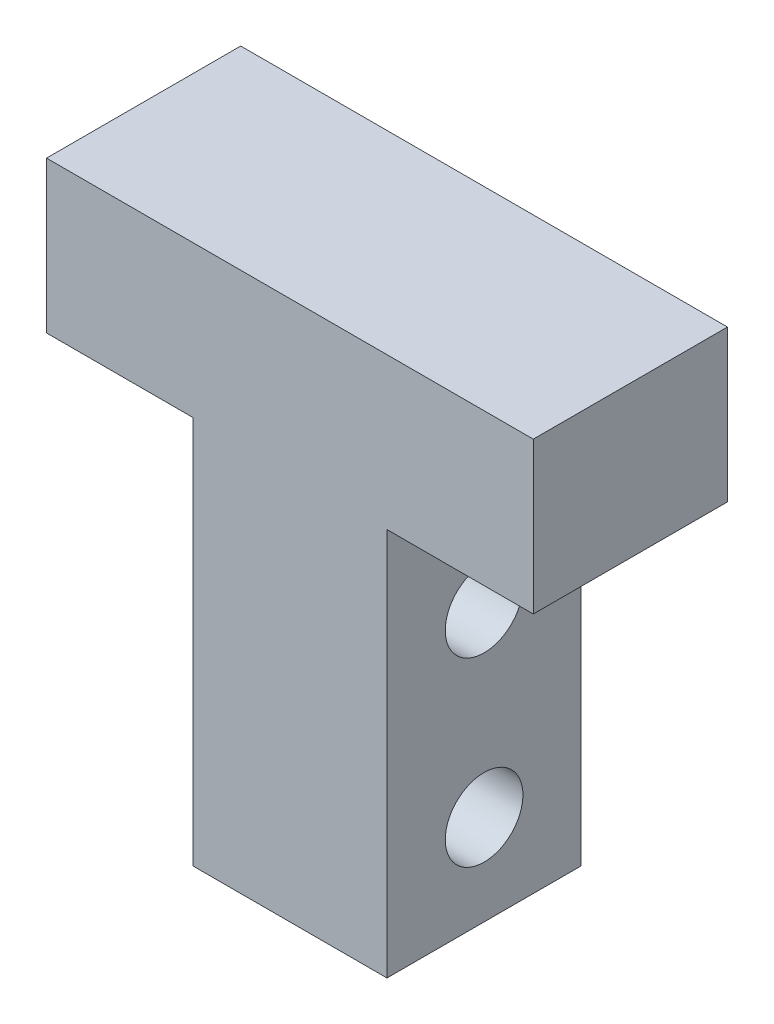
from build123d import *

# Parameters (mm, degrees)
BOSS_EXTRUDE1_DEPTH = 15
SKETCH2_R           = 3
CUT_EXTRUDE1_DEPTH  = 47.924540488


with BuildPart() as part:
    # Sketch1 → Boss-Extrude1 (new body)
    with BuildSketch(Plane.XY):
        Polygon((7.5, -5.85), (18.8, -5.85), (18.8, 5.85), (-18.8, 5.85), (-18.8, -5.85), (-7.5, -5.85), (-7.5, -35.85), (7.5, -35.85), align=None)
    extrude(amount=BOSS_EXTRUDE1_DEPTH)

    # Sketch2 → Cut-Extrude1 (cut, through all)
    with BuildSketch(Plane(origin=(7.5, 0, 0), x_dir=(0, 0, -1), z_dir=(1, 0, 0))):
        with Locations(Location((-7.5, -28.85, 0), (0, 0, 90))):
            Circle(SKETCH2_R)
        with Locations(Location((-7.5, -14.85, 0), (0, 0, 90))):
            Circle(SKETCH2_R)
    extrude(amount=-CUT_EXTRUDE1_DEPTH, mode=Mode.SUBTRACT)


solid = part.part
